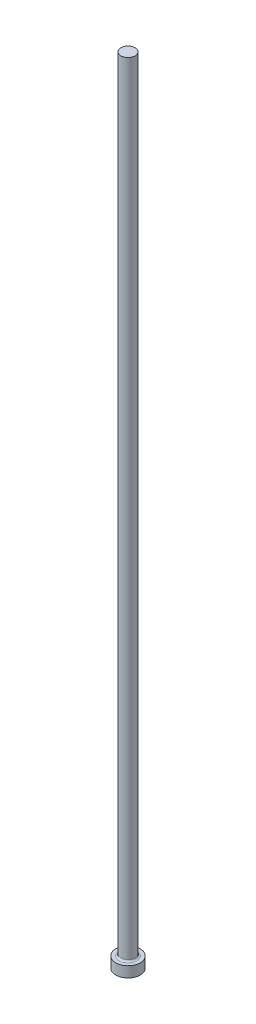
from build123d import *


with BuildPart() as part:
    # Sketch1 → Revolve1 (revolve)
    with BuildSketch(Plane.XY, mode=Mode.PRIVATE) as revolve1_sk:
        with BuildLine():
            Line((0, 0), (5.461, 0))
            Line((5.461, 0), (5.461, 4.7498))
            Line((5.461, 4.7498), (3.937, 4.7498))
            ThreePointArc((3.937, 4.7498), (3.398184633, 4.972984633), (3.175, 5.5118))
            Line((3.175, 5.5118), (3.175, 355.6))
            Line((3.175, 355.6), (0, 355.6))
            Line((0, 355.6), (0, 0))
        make_face()
    revolve(revolve1_sk.sketch.rotate(Axis((0, 355.6, 0), (0, -1, 0)), 180), axis=Axis((0, 355.6, 0), (0, -1, 0)))


solid = part.part
